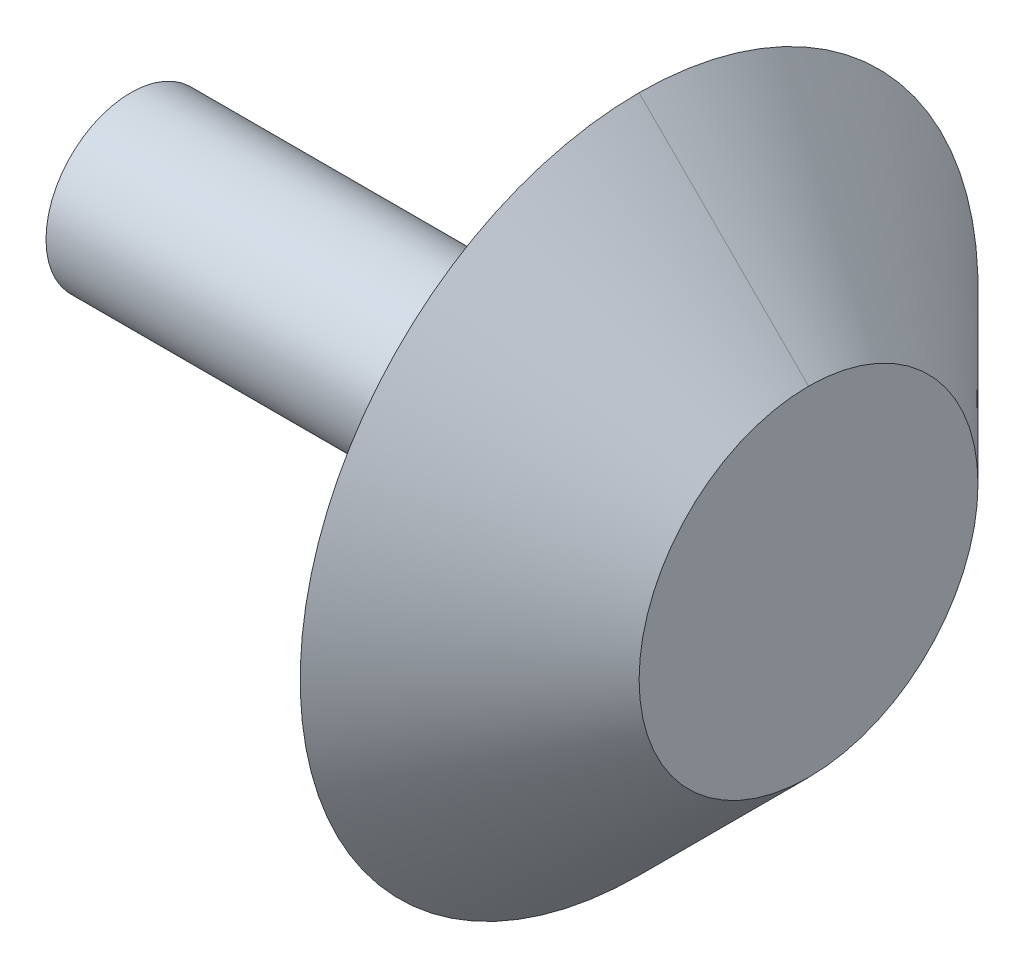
from build123d import *


with BuildPart() as part:
    # Sketch1 → Base-Revolve (revolve)
    with BuildSketch(Plane.XY, mode=Mode.PRIVATE) as base_revolve_sk:
        Polygon((0, 0), (0, 9.525), (57.15, 9.525), (57.15, 38.1), (76.2, 19.05), (76.2, 0), align=None)
    revolve(base_revolve_sk.sketch.rotate(Axis((0, 0, 0), (1, 0, 0)), 90), axis=Axis((0, 0, 0), (1, 0, 0)))


solid = part.part
